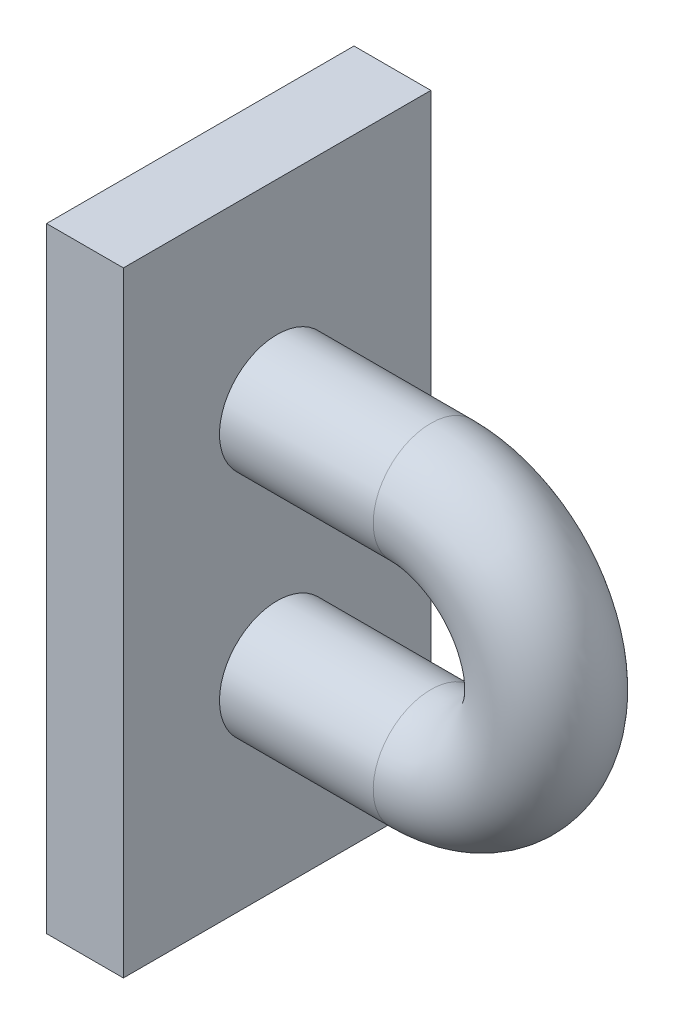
from build123d import *

# Parameters (mm, degrees)
SKETCH2_R           = 7.5
SKETCH4_W           = 40
SKETCH4_H           = 80
BOSS_EXTRUDE1_DEPTH = 10


with BuildPart() as part:
    # Base-Sweep: sweep along a path in Sketch1
    with BuildLine(Plane.XY) as base_sweep_path:
        Line((-20, 15.0005), (0, 15.0005))
        ThreePointArc((0, 15.0005), (15.0005, 0), (0, -15.0005))
        Line((0, -15.0005), (-20, -15.0005))
    # Sketch2 → Base-Sweep (sweep)
    with BuildSketch(Plane(origin=(-20, 0, 0), x_dir=(0, 0, -1), z_dir=(1, 0, 0))):
        with Locations((0, -15.0005)):
            Circle(SKETCH2_R)
    sweep(path=base_sweep_path.line)

    # Sketch4 → Boss-Extrude1 (add)
    with BuildSketch(Plane(origin=(-20, 0, 0), x_dir=(0, 0, -1), z_dir=(1, 0, 0))):
        Rectangle(SKETCH4_W, SKETCH4_H)
    extrude(amount=-BOSS_EXTRUDE1_DEPTH)


solid = part.part
